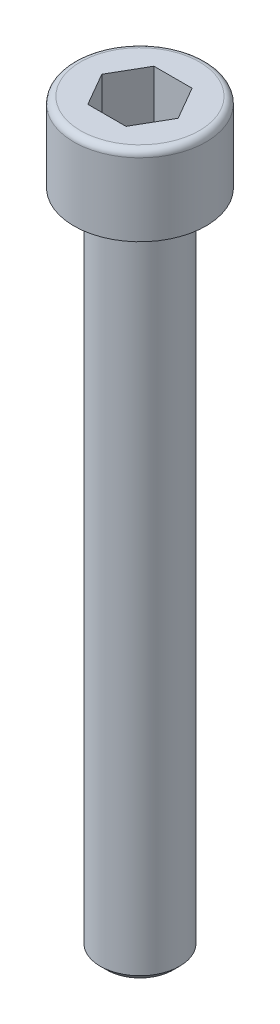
from build123d import *

# Parameters (mm, degrees)
ENL_V_MAT_EXTRU_1_DEPTH = 5
CHANFREIN1_SIZE         = 0.5


with BuildPart() as part:
    # Esquisse1 → Base-R_volution (revolve)
    with BuildSketch(Plane.XY, mode=Mode.PRIVATE) as base_r_volution_sk:
        with BuildLine():
            Line((0, 56), (-4.5, 56))
            ThreePointArc((-4.5, 56), (-4.853553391, 55.853553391), (-5, 55.5))
            Line((-5, 55.5), (-5, 50))
            Line((-5, 50), (-3, 50))
            Line((-3, 50), (-3, 0))
            Line((-3, 0), (0, 0))
            Line((0, 0), (0, 56))
        make_face()
    revolve(base_r_volution_sk.sketch.rotate(Axis((0, 50, 0), (0, -1, 0)), 270), axis=Axis((0, 50, 0), (0, -1, 0)))

    # Esquisse2 → Enl_v. mat.-Extru.1 (cut)
    with BuildSketch(Plane(origin=(0, 56, 0), x_dir=(-1, 0, 0), z_dir=(0, 1, 0))):
        Polygon((1.443375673, 2.5), (-1.443375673, 2.5), (-2.886751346, 0), (-1.443375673, -2.5), (1.443375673, -2.5), (2.886751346, 0), align=None)
    extrude(amount=-ENL_V_MAT_EXTRU_1_DEPTH, mode=Mode.SUBTRACT)

    # Chanfrein1
    chanfrein1_edges = [part.edges().sort_by_distance(p)[0] for p in [
        (0, 0, -3),
    ]]
    chamfer(chanfrein1_edges, length=CHANFREIN1_SIZE)


solid = part.part
